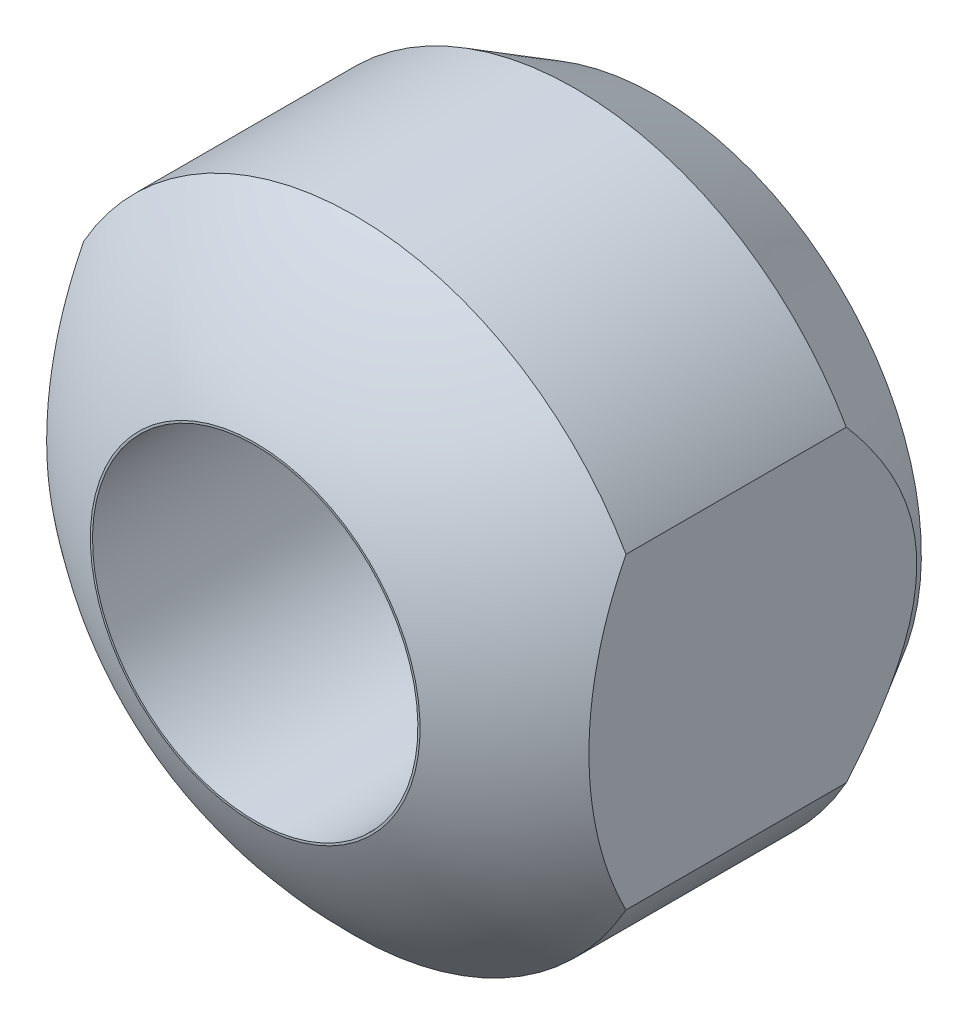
ISO-10303-21;
HEADER;
FILE_DESCRIPTION(('STEP AP214'),'2;1');
FILE_NAME('part.step','',(''),(''),'','','');
FILE_SCHEMA(('AUTOMOTIVE_DESIGN { 1 0 10303 214 1 1 1 1 }'));
ENDSEC;
DATA;
#1=APPLICATION_CONTEXT('core data for automotive mechanical design processes');
#2=APPLICATION_PROTOCOL_DEFINITION('international standard','automotive_design',2000,#1);
#3=PRODUCT_CONTEXT('',#1,'mechanical');
#4=PRODUCT('Part','Part','',(#3));
#5=PRODUCT_RELATED_PRODUCT_CATEGORY('part','',(#4));
#6=PRODUCT_DEFINITION_FORMATION('','',#4);
#7=PRODUCT_DEFINITION_CONTEXT('part definition',#1,'design');
#8=PRODUCT_DEFINITION('design','',#6,#7);
#9=PRODUCT_DEFINITION_SHAPE('','',#8);
#10=(LENGTH_UNIT() NAMED_UNIT(*) SI_UNIT(.MILLI.,.METRE.));
#11=(NAMED_UNIT(*) PLANE_ANGLE_UNIT() SI_UNIT($,.RADIAN.));
#12=(NAMED_UNIT(*) SI_UNIT($,.STERADIAN.) SOLID_ANGLE_UNIT());
#13=UNCERTAINTY_MEASURE_WITH_UNIT(LENGTH_MEASURE(1.E-05),#10,'distance_accuracy_value','');
#14=(GEOMETRIC_REPRESENTATION_CONTEXT(3) GLOBAL_UNCERTAINTY_ASSIGNED_CONTEXT((#13)) GLOBAL_UNIT_ASSIGNED_CONTEXT((#10,
#11,#12)) REPRESENTATION_CONTEXT('',''));
#15=CARTESIAN_POINT('',(0.,0.,0.));
#16=DIRECTION('',(0.,0.,1.));
#17=DIRECTION('',(1.,0.,0.));
#18=AXIS2_PLACEMENT_3D('',#15,#16,#17);
#19=CARTESIAN_POINT('',(-1.29479760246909E-11,0.,2.0648413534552E-11));
#20=DIRECTION('',(0.,0.,1.));
#21=DIRECTION('',(-1.,0.,0.));
#22=AXIS2_PLACEMENT_3D('',#19,#20,#21);
#23=SPHERICAL_SURFACE('',#22,15.999999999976);
#24=CARTESIAN_POINT('',(0.,0.,14.8));
#25=DIRECTION('',(0.,0.,1.));
#26=DIRECTION('',(0.,1.,0.));
#27=AXIS2_PLACEMENT_3D('',#24,#25,#26);
#28=CIRCLE('',#27,6.0794736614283);
#29=CARTESIAN_POINT('',(0.,6.0794736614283,14.8));
#30=VERTEX_POINT('',#29);
#31=EDGE_CURVE('E88',#30,#30,#28,.T.);
#32=ORIENTED_EDGE('',*,*,#31,.F.);
#33=EDGE_LOOP('',(#32));
#34=FACE_BOUND('',#33,.T.);
#35=CARTESIAN_POINT('',(10.,0.,2.0648413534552E-11));
#36=DIRECTION('',(-1.,0.,0.));
#37=DIRECTION('',(0.,-1.,0.));
#38=AXIS2_PLACEMENT_3D('',#35,#36,#37);
#39=CIRCLE('',#38,12.4899959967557);
#40=CARTESIAN_POINT('',(10.,5.67890834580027,11.124297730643));
#41=VERTEX_POINT('',#40);
#42=CARTESIAN_POINT('',(10.,-5.67890834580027,11.124297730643));
#43=VERTEX_POINT('',#42);
#44=EDGE_CURVE('E113',#41,#43,#39,.F.);
#45=ORIENTED_EDGE('',*,*,#44,.F.);
#46=CARTESIAN_POINT('',(0.,0.,11.124297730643));
#47=DIRECTION('',(0.,0.,1.));
#48=DIRECTION('',(0.,1.,0.));
#49=AXIS2_PLACEMENT_3D('',#46,#47,#48);
#50=CIRCLE('',#49,11.5);
#51=CARTESIAN_POINT('',(-10.,5.67890834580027,11.124297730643));
#52=VERTEX_POINT('',#51);
#53=EDGE_CURVE('E73',#41,#52,#50,.T.);
#54=ORIENTED_EDGE('',*,*,#53,.T.);
#55=CARTESIAN_POINT('',(-10.,0.,2.0648413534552E-11));
#56=DIRECTION('',(1.,0.,0.));
#57=DIRECTION('',(0.,1.,0.));
#58=AXIS2_PLACEMENT_3D('',#55,#56,#57);
#59=CIRCLE('',#58,12.4899959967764);
#60=CARTESIAN_POINT('',(-10.,-5.67890834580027,11.124297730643));
#61=VERTEX_POINT('',#60);
#62=EDGE_CURVE('E81',#61,#52,#59,.F.);
#63=ORIENTED_EDGE('',*,*,#62,.F.);
#64=EDGE_CURVE('E85',#61,#43,#50,.T.);
#65=ORIENTED_EDGE('',*,*,#64,.T.);
#66=EDGE_LOOP('',(#45,#54,#63,#65));
#67=FACE_BOUND('',#66,.T.);
#68=ADVANCED_FACE('F14',(#34,#67),#23,.T.);
#69=CARTESIAN_POINT('',(0.,0.,0.));
#70=DIRECTION('',(0.,0.,1.));
#71=DIRECTION('',(0.,1.,0.));
#72=AXIS2_PLACEMENT_3D('',#69,#70,#71);
#73=CYLINDRICAL_SURFACE('',#72,11.5);
#74=ORIENTED_EDGE('',*,*,#53,.F.);
#75=DIRECTION('',(0.,0.,1.));
#76=VECTOR('',#75,1.);
#77=CARTESIAN_POINT('',(10.,5.67890834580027,0.));
#78=LINE('',#77,#76);
#79=CARTESIAN_POINT('',(10.,5.67890834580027,3.));
#80=VERTEX_POINT('',#79);
#81=EDGE_CURVE('E61',#41,#80,#78,.F.);
#82=ORIENTED_EDGE('',*,*,#81,.T.);
#83=CARTESIAN_POINT('',(0.,0.,3.));
#84=DIRECTION('',(0.,0.,1.));
#85=DIRECTION('',(0.,1.,0.));
#86=AXIS2_PLACEMENT_3D('',#83,#84,#85);
#87=CIRCLE('',#86,11.5);
#88=CARTESIAN_POINT('',(-10.,5.67890834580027,3.));
#89=VERTEX_POINT('',#88);
#90=EDGE_CURVE('E72',#80,#89,#87,.T.);
#91=ORIENTED_EDGE('',*,*,#90,.T.);
#92=DIRECTION('',(0.,0.,1.));
#93=VECTOR('',#92,1.);
#94=CARTESIAN_POINT('',(-10.,5.67890834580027,0.));
#95=LINE('',#94,#93);
#96=EDGE_CURVE('E115',#89,#52,#95,.T.);
#97=ORIENTED_EDGE('',*,*,#96,.T.);
#98=EDGE_LOOP('',(#74,#82,#91,#97));
#99=FACE_BOUND('',#98,.T.);
#100=ADVANCED_FACE('F70',(#99),#73,.T.);
#101=CARTESIAN_POINT('',(0.,0.,3.));
#102=DIRECTION('',(0.,0.,1.));
#103=DIRECTION('',(0.,1.,0.));
#104=AXIS2_PLACEMENT_3D('',#101,#102,#103);
#105=CONICAL_SURFACE('',#104,11.5,0.5235987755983);
#106=CARTESIAN_POINT('',(0.,0.,0.));
#107=DIRECTION('',(0.,0.,1.));
#108=DIRECTION('',(0.,1.,0.));
#109=AXIS2_PLACEMENT_3D('',#106,#107,#108);
#110=CIRCLE('',#109,9.7679491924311);
#111=CARTESIAN_POINT('',(0.,9.7679491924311,0.));
#112=VERTEX_POINT('',#111);
#113=EDGE_CURVE('E78',#112,#112,#110,.T.);
#114=ORIENTED_EDGE('',*,*,#113,.T.);
#115=EDGE_LOOP('',(#114));
#116=FACE_BOUND('',#115,.T.);
#117=ORIENTED_EDGE('',*,*,#90,.F.);
#118=CARTESIAN_POINT('',(10.,-9.74096635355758,7.26114434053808));
#119=CARTESIAN_POINT('',(10.,-9.5393113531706,7.0174829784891));
#120=CARTESIAN_POINT('',(10.,-9.33578799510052,6.77534436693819));
#121=CARTESIAN_POINT('',(10.,-8.9242992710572,6.29476112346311));
#122=CARTESIAN_POINT('',(10.,-8.71633271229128,6.05631751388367));
#123=CARTESIAN_POINT('',(10.,-8.2934250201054,5.58173321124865));
#124=CARTESIAN_POINT('',(10.,-8.07843732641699,5.34563387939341));
#125=CARTESIAN_POINT('',(10.,-7.64250872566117,4.87902268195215));
#126=CARTESIAN_POINT('',(10.,-7.42156837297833,4.64851029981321));
#127=CARTESIAN_POINT('',(10.,-6.95891616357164,4.18040391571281));
#128=CARTESIAN_POINT('',(10.,-6.71676212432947,3.94324496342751));
#129=CARTESIAN_POINT('',(10.,-6.22306041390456,3.47873116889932));
#130=CARTESIAN_POINT('',(10.,-5.97151048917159,3.25137870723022));
#131=CARTESIAN_POINT('',(10.,-5.45829705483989,2.81034367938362));
#132=CARTESIAN_POINT('',(10.,-5.196675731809,2.5966123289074));
#133=CARTESIAN_POINT('',(10.,-4.66055045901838,2.18609383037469));
#134=CARTESIAN_POINT('',(10.,-4.38605508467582,1.98929564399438));
#135=CARTESIAN_POINT('',(10.,-3.91506338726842,1.67957896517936));
#136=CARTESIAN_POINT('',(10.,-3.72269326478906,1.56039961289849));
#137=CARTESIAN_POINT('',(10.,-3.33060729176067,1.33453148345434));
#138=CARTESIAN_POINT('',(10.,-3.13088919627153,1.22784656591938));
#139=CARTESIAN_POINT('',(10.,-2.72583814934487,1.03074298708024));
#140=CARTESIAN_POINT('',(10.,-2.52057561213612,0.940180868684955));
#141=CARTESIAN_POINT('',(10.,-2.10293386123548,0.777263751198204));
#142=CARTESIAN_POINT('',(10.,-1.89055768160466,0.704901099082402));
#143=CARTESIAN_POINT('',(10.,-1.51247785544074,0.596710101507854));
#144=CARTESIAN_POINT('',(10.,-1.34809114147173,0.556274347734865));
#145=CARTESIAN_POINT('',(10.,-1.01657143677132,0.48885756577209));
#146=CARTESIAN_POINT('',(10.,-0.849438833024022,0.461874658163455));
#147=CARTESIAN_POINT('',(10.,-0.51348808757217,0.422314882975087));
#148=CARTESIAN_POINT('',(10.,-0.344670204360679,0.409735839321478));
#149=CARTESIAN_POINT('',(10.,-0.00657286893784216,0.39945347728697));
#150=CARTESIAN_POINT('',(10.,0.16270659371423,0.4017504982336));
#151=CARTESIAN_POINT('',(10.,0.500267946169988,0.421124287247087));
#152=CARTESIAN_POINT('',(10.,0.668550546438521,0.438188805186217));
#153=CARTESIAN_POINT('',(10.,1.00305800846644,0.48644386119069));
#154=CARTESIAN_POINT('',(10.,1.16928285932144,0.517634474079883));
#155=CARTESIAN_POINT('',(10.,1.49882987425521,0.593107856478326));
#156=CARTESIAN_POINT('',(10.,1.66214995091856,0.637399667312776));
#157=CARTESIAN_POINT('',(10.,1.98511493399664,0.737753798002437));
#158=CARTESIAN_POINT('',(10.,2.14475935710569,0.793817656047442));
#159=CARTESIAN_POINT('',(10.,2.55709985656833,0.954061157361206));
#160=CARTESIAN_POINT('',(10.,2.80655538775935,1.06660992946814));
#161=CARTESIAN_POINT('',(10.,3.29458596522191,1.3132309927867));
#162=CARTESIAN_POINT('',(10.,3.53315299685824,1.44731882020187));
#163=CARTESIAN_POINT('',(10.,4.00233898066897,1.73376354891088));
#164=CARTESIAN_POINT('',(10.,4.23285152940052,1.88629346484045));
#165=CARTESIAN_POINT('',(10.,4.57139707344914,2.12508242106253));
#166=CARTESIAN_POINT('',(10.,4.68302377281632,2.20633010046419));
#167=CARTESIAN_POINT('',(10.,4.9040472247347,2.371808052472));
#168=CARTESIAN_POINT('',(10.,5.01344398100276,2.45603832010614));
#169=CARTESIAN_POINT('',(10.,5.30694808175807,2.68778079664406));
#170=CARTESIAN_POINT('',(10.,5.48905229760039,2.83783202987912));
#171=CARTESIAN_POINT('',(10.,5.84785008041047,3.14429203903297));
#172=CARTESIAN_POINT('',(10.,6.02454277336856,3.30070183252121));
#173=CARTESIAN_POINT('',(10.,6.37320760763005,3.6188792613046));
#174=CARTESIAN_POINT('',(10.,6.54517702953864,3.78064986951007));
#175=CARTESIAN_POINT('',(10.,6.88484137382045,4.10862620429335));
#176=CARTESIAN_POINT('',(10.,7.05253599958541,4.2748322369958));
#177=CARTESIAN_POINT('',(10.,7.55117191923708,4.78029629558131));
#178=CARTESIAN_POINT('',(10.,7.87638288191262,5.12521253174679));
#179=CARTESIAN_POINT('',(10.,8.51457007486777,5.82589879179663));
#180=CARTESIAN_POINT('',(10.,8.82754989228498,6.18166557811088));
#181=CARTESIAN_POINT('',(10.,9.42111784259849,6.87509683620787));
#182=CARTESIAN_POINT('',(10.,9.70239679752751,7.21217196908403));
#183=CARTESIAN_POINT('',(10.,10.2580346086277,7.89201687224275));
#184=CARTESIAN_POINT('',(10.,10.5323927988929,8.23478718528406));
#185=CARTESIAN_POINT('',(10.,11.0729287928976,8.92186503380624));
#186=CARTESIAN_POINT('',(10.,11.3391571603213,9.26613289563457));
#187=CARTESIAN_POINT('',(10.,11.866689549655,9.95830389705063));
#188=CARTESIAN_POINT('',(10.,12.127994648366,10.306206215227));
#189=CARTESIAN_POINT('',(10.,12.3872869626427,10.6555817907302));
#190=B_SPLINE_CURVE_WITH_KNOTS('',3,(#118,#119,#120,#121,#122,#123,#124,#125,#126,#127,#128,
#129,#130,#131,#132,#133,#134,#135,#136,#137,#138,#139,#140,#141,#142,#143,#144,#145,#146,#147,
#148,#149,#150,#151,#152,#153,#154,#155,#156,#157,#158,#159,#160,#161,#162,#163,#164,#165,#166,
#167,#168,#169,#170,#171,#172,#173,#174,#175,#176,#177,#178,#179,#180,#181,#182,#183,#184,#185,
#186,#187,#188,#189),.UNSPECIFIED.,.F.,.F.,(4,2,2,2,2,2,2,2,2,2,2,2,2,2,2,2,2,2,2,2,2,2,2,2,2,2,
2,2,2,2,2,2,2,2,2,4),(0.,0.948869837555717,1.89799768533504,2.85585644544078,3.81362630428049,
4.83024106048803,5.8471012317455,6.86008697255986,7.87240728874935,8.55092366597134,
9.22964909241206,9.90199540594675,10.5740585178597,11.0814214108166,11.5887134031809,
12.095928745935,12.6031556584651,13.1099622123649,13.6167714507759,14.1239312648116,
14.631157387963,15.4507482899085,16.2709330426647,17.0995164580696,17.513670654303,
17.9278241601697,18.6355159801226,19.3433215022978,20.0515263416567,20.7597801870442,
22.1815262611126,23.6028521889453,24.9197972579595,26.2368685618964,27.5424190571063,
28.8476806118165),.UNSPECIFIED.);
#191=CARTESIAN_POINT('',(10.,-5.67890834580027,3.));
#192=VERTEX_POINT('',#191);
#193=EDGE_CURVE('E9',#192,#80,#190,.T.);
#194=ORIENTED_EDGE('',*,*,#193,.F.);
#195=CARTESIAN_POINT('',(-10.,-5.67890834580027,3.));
#196=VERTEX_POINT('',#195);
#197=EDGE_CURVE('E77',#196,#192,#87,.T.);
#198=ORIENTED_EDGE('',*,*,#197,.F.);
#199=CARTESIAN_POINT('',(-10.,-9.74096635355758,7.26114434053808));
#200=CARTESIAN_POINT('',(-10.,-9.5393113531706,7.0174829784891));
#201=CARTESIAN_POINT('',(-10.,-9.33578799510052,6.77534436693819));
#202=CARTESIAN_POINT('',(-10.,-8.9242992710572,6.29476112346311));
#203=CARTESIAN_POINT('',(-10.,-8.71633271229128,6.05631751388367));
#204=CARTESIAN_POINT('',(-10.,-8.2934250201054,5.58173321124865));
#205=CARTESIAN_POINT('',(-10.,-8.07843732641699,5.34563387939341));
#206=CARTESIAN_POINT('',(-10.,-7.64250872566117,4.87902268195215));
#207=CARTESIAN_POINT('',(-10.,-7.42156837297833,4.64851029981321));
#208=CARTESIAN_POINT('',(-10.,-6.95891616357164,4.18040391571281));
#209=CARTESIAN_POINT('',(-10.,-6.71676212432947,3.94324496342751));
#210=CARTESIAN_POINT('',(-10.,-6.22306041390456,3.47873116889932));
#211=CARTESIAN_POINT('',(-10.,-5.97151048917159,3.25137870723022));
#212=CARTESIAN_POINT('',(-10.,-5.45829705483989,2.81034367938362));
#213=CARTESIAN_POINT('',(-10.,-5.196675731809,2.5966123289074));
#214=CARTESIAN_POINT('',(-10.,-4.66055045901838,2.18609383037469));
#215=CARTESIAN_POINT('',(-10.,-4.38605508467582,1.98929564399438));
#216=CARTESIAN_POINT('',(-10.,-3.91506338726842,1.67957896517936));
#217=CARTESIAN_POINT('',(-10.,-3.72269326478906,1.56039961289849));
#218=CARTESIAN_POINT('',(-10.,-3.33060729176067,1.33453148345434));
#219=CARTESIAN_POINT('',(-10.,-3.13088919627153,1.22784656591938));
#220=CARTESIAN_POINT('',(-10.,-2.72583814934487,1.03074298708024));
#221=CARTESIAN_POINT('',(-10.,-2.52057561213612,0.940180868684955));
#222=CARTESIAN_POINT('',(-10.,-2.10293386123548,0.777263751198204));
#223=CARTESIAN_POINT('',(-10.,-1.89055768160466,0.704901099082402));
#224=CARTESIAN_POINT('',(-10.,-1.51247785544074,0.596710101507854));
#225=CARTESIAN_POINT('',(-10.,-1.34809114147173,0.556274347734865));
#226=CARTESIAN_POINT('',(-10.,-1.01657143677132,0.48885756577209));
#227=CARTESIAN_POINT('',(-10.,-0.849438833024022,0.461874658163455));
#228=CARTESIAN_POINT('',(-10.,-0.51348808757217,0.422314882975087));
#229=CARTESIAN_POINT('',(-10.,-0.344670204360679,0.409735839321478));
#230=CARTESIAN_POINT('',(-10.,-0.00657286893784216,0.39945347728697));
#231=CARTESIAN_POINT('',(-10.,0.16270659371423,0.4017504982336));
#232=CARTESIAN_POINT('',(-10.,0.500267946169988,0.421124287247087));
#233=CARTESIAN_POINT('',(-10.,0.668550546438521,0.438188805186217));
#234=CARTESIAN_POINT('',(-10.,1.00305800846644,0.48644386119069));
#235=CARTESIAN_POINT('',(-10.,1.16928285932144,0.517634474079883));
#236=CARTESIAN_POINT('',(-10.,1.49882987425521,0.593107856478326));
#237=CARTESIAN_POINT('',(-10.,1.66214995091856,0.637399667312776));
#238=CARTESIAN_POINT('',(-10.,1.98511493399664,0.737753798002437));
#239=CARTESIAN_POINT('',(-10.,2.14475935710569,0.793817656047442));
#240=CARTESIAN_POINT('',(-10.,2.55709985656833,0.954061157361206));
#241=CARTESIAN_POINT('',(-10.,2.80655538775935,1.06660992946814));
#242=CARTESIAN_POINT('',(-10.,3.29458596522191,1.3132309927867));
#243=CARTESIAN_POINT('',(-10.,3.53315299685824,1.44731882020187));
#244=CARTESIAN_POINT('',(-10.,4.00233898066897,1.73376354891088));
#245=CARTESIAN_POINT('',(-10.,4.23285152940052,1.88629346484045));
#246=CARTESIAN_POINT('',(-10.,4.57139707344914,2.12508242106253));
#247=CARTESIAN_POINT('',(-10.,4.68302377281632,2.20633010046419));
#248=CARTESIAN_POINT('',(-10.,4.9040472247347,2.371808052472));
#249=CARTESIAN_POINT('',(-10.,5.01344398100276,2.45603832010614));
#250=CARTESIAN_POINT('',(-10.,5.30694808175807,2.68778079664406));
#251=CARTESIAN_POINT('',(-10.,5.48905229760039,2.83783202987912));
#252=CARTESIAN_POINT('',(-10.,5.84785008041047,3.14429203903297));
#253=CARTESIAN_POINT('',(-10.,6.02454277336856,3.30070183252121));
#254=CARTESIAN_POINT('',(-10.,6.37320760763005,3.6188792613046));
#255=CARTESIAN_POINT('',(-10.,6.54517702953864,3.78064986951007));
#256=CARTESIAN_POINT('',(-10.,6.88484137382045,4.10862620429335));
#257=CARTESIAN_POINT('',(-10.,7.05253599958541,4.2748322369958));
#258=CARTESIAN_POINT('',(-10.,7.55117191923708,4.78029629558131));
#259=CARTESIAN_POINT('',(-10.,7.87638288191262,5.12521253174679));
#260=CARTESIAN_POINT('',(-10.,8.51457007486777,5.82589879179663));
#261=CARTESIAN_POINT('',(-10.,8.82754989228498,6.18166557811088));
#262=CARTESIAN_POINT('',(-10.,9.42111784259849,6.87509683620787));
#263=CARTESIAN_POINT('',(-10.,9.70239679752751,7.21217196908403));
#264=CARTESIAN_POINT('',(-10.,10.2580346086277,7.89201687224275));
#265=CARTESIAN_POINT('',(-10.,10.5323927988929,8.23478718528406));
#266=CARTESIAN_POINT('',(-10.,11.0729287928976,8.92186503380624));
#267=CARTESIAN_POINT('',(-10.,11.3391571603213,9.26613289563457));
#268=CARTESIAN_POINT('',(-10.,11.866689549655,9.95830389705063));
#269=CARTESIAN_POINT('',(-10.,12.127994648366,10.306206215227));
#270=CARTESIAN_POINT('',(-10.,12.3872869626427,10.6555817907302));
#271=B_SPLINE_CURVE_WITH_KNOTS('',3,(#199,#200,#201,#202,#203,#204,#205,#206,#207,#208,#209,
#210,#211,#212,#213,#214,#215,#216,#217,#218,#219,#220,#221,#222,#223,#224,#225,#226,#227,#228,
#229,#230,#231,#232,#233,#234,#235,#236,#237,#238,#239,#240,#241,#242,#243,#244,#245,#246,#247,
#248,#249,#250,#251,#252,#253,#254,#255,#256,#257,#258,#259,#260,#261,#262,#263,#264,#265,#266,
#267,#268,#269,#270),.UNSPECIFIED.,.F.,.F.,(4,2,2,2,2,2,2,2,2,2,2,2,2,2,2,2,2,2,2,2,2,2,2,2,2,2,
2,2,2,2,2,2,2,2,2,4),(0.,0.948869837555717,1.89799768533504,2.85585644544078,3.81362630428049,
4.83024106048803,5.8471012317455,6.86008697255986,7.87240728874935,8.55092366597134,
9.22964909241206,9.90199540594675,10.5740585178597,11.0814214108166,11.5887134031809,
12.095928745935,12.6031556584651,13.1099622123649,13.6167714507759,14.1239312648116,
14.631157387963,15.4507482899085,16.2709330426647,17.0995164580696,17.513670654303,
17.9278241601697,18.6355159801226,19.3433215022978,20.0515263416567,20.7597801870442,
22.1815262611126,23.6028521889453,24.9197972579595,26.2368685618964,27.5424190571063,
28.8476806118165),.UNSPECIFIED.);
#272=EDGE_CURVE('E28',#89,#196,#271,.F.);
#273=ORIENTED_EDGE('',*,*,#272,.F.);
#274=EDGE_LOOP('',(#117,#194,#198,#273));
#275=FACE_BOUND('',#274,.T.);
#276=ADVANCED_FACE('F76',(#116,#275),#105,.T.);
#277=DIRECTION('',(0.,0.,1.));
#278=VECTOR('',#277,1.);
#279=CARTESIAN_POINT('',(10.,-5.67890834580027,0.));
#280=LINE('',#279,#278);
#281=EDGE_CURVE('E64',#43,#192,#280,.F.);
#282=ORIENTED_EDGE('',*,*,#281,.F.);
#283=ORIENTED_EDGE('',*,*,#64,.F.);
#284=DIRECTION('',(0.,0.,1.));
#285=VECTOR('',#284,1.);
#286=CARTESIAN_POINT('',(-10.,-5.67890834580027,0.));
#287=LINE('',#286,#285);
#288=EDGE_CURVE('E35',#196,#61,#287,.T.);
#289=ORIENTED_EDGE('',*,*,#288,.F.);
#290=ORIENTED_EDGE('',*,*,#197,.T.);
#291=EDGE_LOOP('',(#282,#283,#289,#290));
#292=FACE_BOUND('',#291,.T.);
#293=ADVANCED_FACE('F101',(#292),#73,.T.);
#294=CARTESIAN_POINT('',(0.,0.,14.8));
#295=DIRECTION('',(0.,0.,1.));
#296=DIRECTION('',(0.,1.,0.));
#297=AXIS2_PLACEMENT_3D('',#294,#295,#296);
#298=PLANE('',#297);
#299=CARTESIAN_POINT('',(0.,0.,14.8));
#300=DIRECTION('',(0.,0.,1.));
#301=DIRECTION('',(0.,1.,0.));
#302=AXIS2_PLACEMENT_3D('',#299,#300,#301);
#303=CIRCLE('',#302,6.);
#304=CARTESIAN_POINT('',(0.,6.,14.8));
#305=VERTEX_POINT('',#304);
#306=EDGE_CURVE('E74',#305,#305,#303,.T.);
#307=ORIENTED_EDGE('',*,*,#306,.F.);
#308=EDGE_LOOP('',(#307));
#309=FACE_BOUND('',#308,.T.);
#310=ORIENTED_EDGE('',*,*,#31,.T.);
#311=EDGE_LOOP('',(#310));
#312=FACE_BOUND('',#311,.T.);
#313=ADVANCED_FACE('F16',(#309,#312),#298,.T.);
#314=CARTESIAN_POINT('',(-9.7679491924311,0.,0.));
#315=DIRECTION('',(0.,0.,-1.));
#316=DIRECTION('',(0.,-1.,0.));
#317=AXIS2_PLACEMENT_3D('',#314,#315,#316);
#318=PLANE('',#317);
#319=CARTESIAN_POINT('',(0.,0.,0.));
#320=DIRECTION('',(0.,0.,1.));
#321=DIRECTION('',(0.,1.,0.));
#322=AXIS2_PLACEMENT_3D('',#319,#320,#321);
#323=CIRCLE('',#322,6.);
#324=CARTESIAN_POINT('',(0.,6.,0.));
#325=VERTEX_POINT('',#324);
#326=EDGE_CURVE('E134',#325,#325,#323,.T.);
#327=ORIENTED_EDGE('',*,*,#326,.T.);
#328=EDGE_LOOP('',(#327));
#329=FACE_BOUND('',#328,.T.);
#330=ORIENTED_EDGE('',*,*,#113,.F.);
#331=EDGE_LOOP('',(#330));
#332=FACE_BOUND('',#331,.T.);
#333=ADVANCED_FACE('F103',(#329,#332),#318,.T.);
#334=CARTESIAN_POINT('',(-10.,-11.5,14.8));
#335=DIRECTION('',(1.,0.,0.));
#336=DIRECTION('',(0.,1.,0.));
#337=AXIS2_PLACEMENT_3D('',#334,#335,#336);
#338=PLANE('',#337);
#339=ORIENTED_EDGE('',*,*,#62,.T.);
#340=ORIENTED_EDGE('',*,*,#96,.F.);
#341=ORIENTED_EDGE('',*,*,#272,.T.);
#342=ORIENTED_EDGE('',*,*,#288,.T.);
#343=EDGE_LOOP('',(#339,#340,#341,#342));
#344=FACE_BOUND('',#343,.T.);
#345=ADVANCED_FACE('F95',(#344),#338,.F.);
#346=CARTESIAN_POINT('',(10.,-11.5,0.));
#347=DIRECTION('',(-1.,0.,0.));
#348=DIRECTION('',(0.,-1.,0.));
#349=AXIS2_PLACEMENT_3D('',#346,#347,#348);
#350=PLANE('',#349);
#351=ORIENTED_EDGE('',*,*,#44,.T.);
#352=ORIENTED_EDGE('',*,*,#281,.T.);
#353=ORIENTED_EDGE('',*,*,#193,.T.);
#354=ORIENTED_EDGE('',*,*,#81,.F.);
#355=EDGE_LOOP('',(#351,#352,#353,#354));
#356=FACE_BOUND('',#355,.T.);
#357=ADVANCED_FACE('F60',(#356),#350,.F.);
#358=CARTESIAN_POINT('',(0.,0.,14.8));
#359=DIRECTION('',(0.,0.,-1.));
#360=DIRECTION('',(0.,-1.,0.));
#361=AXIS2_PLACEMENT_3D('',#358,#359,#360);
#362=CYLINDRICAL_SURFACE('',#361,6.);
#363=ORIENTED_EDGE('',*,*,#306,.T.);
#364=EDGE_LOOP('',(#363));
#365=FACE_BOUND('',#364,.T.);
#366=ORIENTED_EDGE('',*,*,#326,.F.);
#367=EDGE_LOOP('',(#366));
#368=FACE_BOUND('',#367,.T.);
#369=ADVANCED_FACE('F141',(#365,#368),#362,.F.);
#370=CLOSED_SHELL('',(#68,#100,#276,#293,#313,#333,#345,#357,#369));
#371=MANIFOLD_SOLID_BREP('B1',#370);
#372=ADVANCED_BREP_SHAPE_REPRESENTATION('',(#18,#371),#14);
#373=SHAPE_DEFINITION_REPRESENTATION(#9,#372);
ENDSEC;
END-ISO-10303-21;
